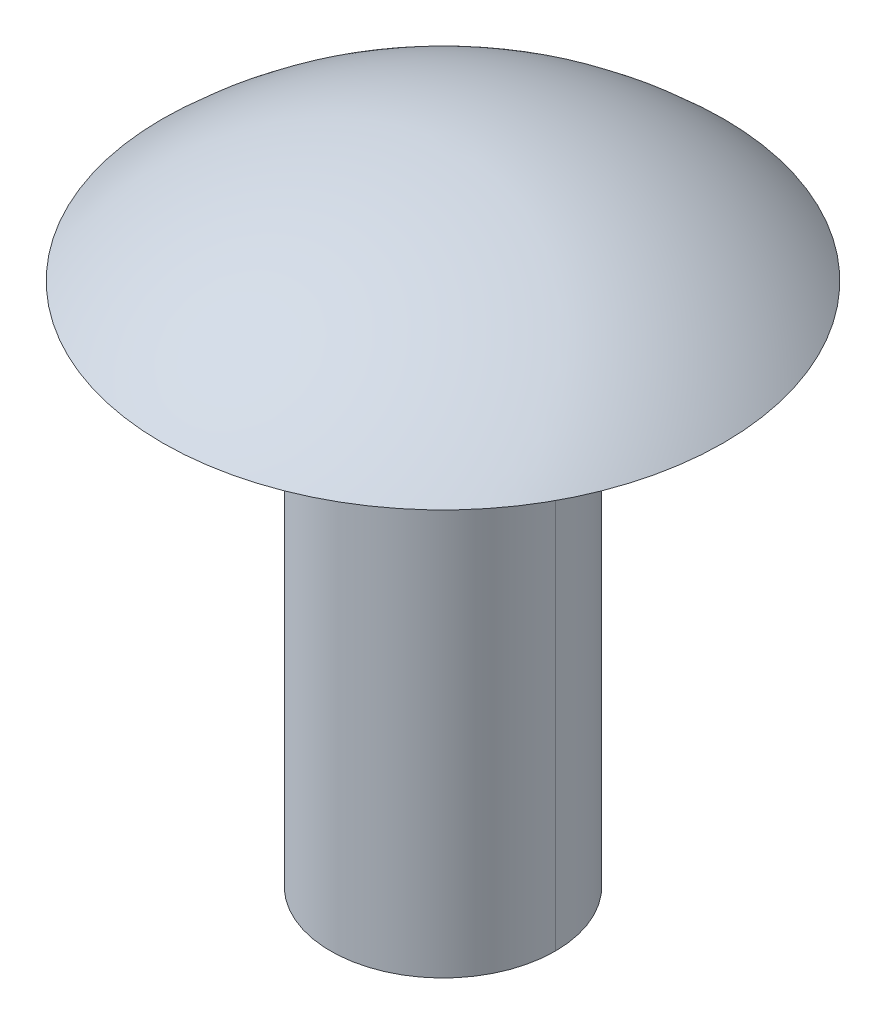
from build123d import *

# Parameters (mm, degrees)
SKETCH1_R           = 4.7625
BOSS_EXTRUDE1_DEPTH = 22.2377


with BuildPart() as part:
    # Sketch1 → Boss-Extrude1 (new body)
    with BuildSketch(Plane(origin=(0, 0, 0), x_dir=(1, 0, 0), z_dir=(0, 1, 0))):
        with Locations(Location((0, 0, 0), (0, 0, 270))):
            Circle(SKETCH1_R)
    extrude(amount=-BOSS_EXTRUDE1_DEPTH)

    # Sketch3 → Revolve1 (revolve)
    with BuildSketch(Plane.XY):
        with BuildLine():
            Line((0, 4.7498), (0, 0))
            Line((0, 0), (11.8999, 0))
            ThreePointArc((11.8999, 0), (6.406407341, 3.5184843), (0, 4.7498))
        make_face()
    revolve(axis=Axis((0, 4.7498, 0), (0, -1, 0)))


solid = part.part
